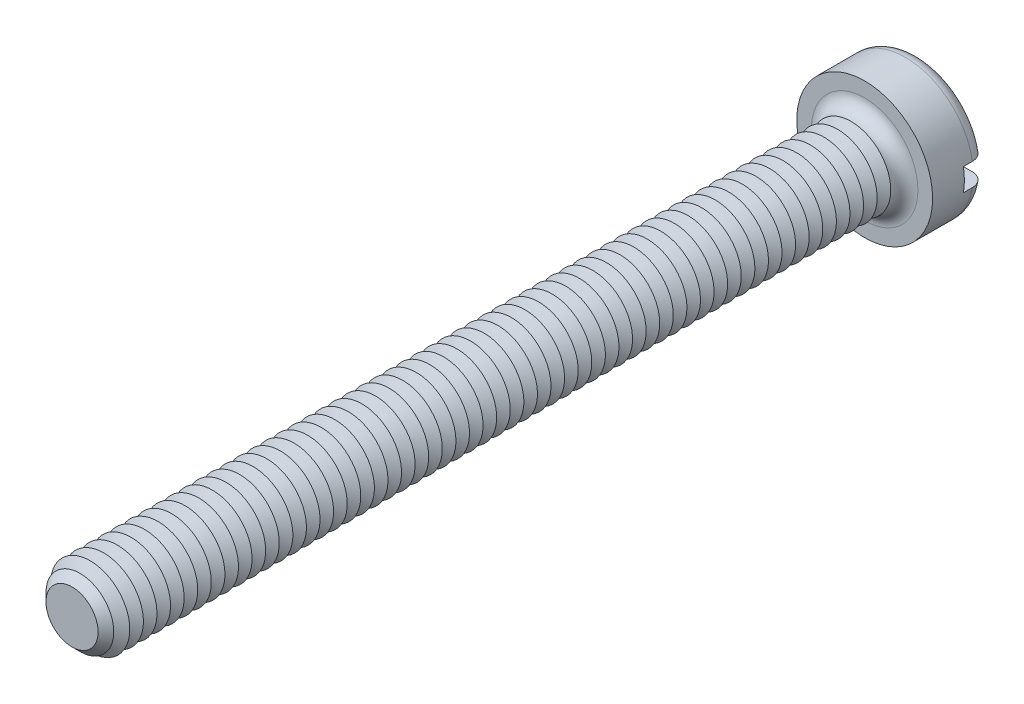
from build123d import *

# Parameters (mm, degrees)
SKETCH3_R           = 3
BOSS_EXTRUDE2_DEPTH = 2.4
SKETCH4_R           = 1.75
BOSS_EXTRUDE3_DEPTH = 35
FILLET1_R           = 0.6
CHAMFER1_SIZE       = 0.6
LPATTERN1_COUNT     = 57
LPATTERN1_PITCH     = 0.6
SKETCH8_W           = 6
SKETCH8_H           = 1
CUT_EXTRUDE1_DEPTH  = 1


with BuildPart() as part:
    # Sketch3 → Boss-Extrude2 (new body)
    with BuildSketch(Plane.XY):
        Circle(SKETCH3_R)
    extrude(amount=-BOSS_EXTRUDE2_DEPTH)

    # Sketch4 → Boss-Extrude3 (add)
    with BuildSketch(Plane.XY):
        Circle(SKETCH4_R)
    extrude(amount=BOSS_EXTRUDE3_DEPTH)

    # Fillet1
    fillet1_edges = [part.edges().sort_by_distance(p)[0] for p in [
        (-3, 0, -2.4),
        (-1.75, 0, 0),
    ]]
    fillet(fillet1_edges, radius=FILLET1_R)

    # Chamfer1
    chamfer1_edges = [part.edges().sort_by_distance(p)[0] for p in [
        (-1.75, 0, 35),
    ]]
    chamfer(chamfer1_edges, length=CHAMFER1_SIZE)

    # Sketch6 → Cut-Revolve1 (revolve, cut)
    with BuildSketch(Plane(origin=(0, 0, 0), x_dir=(0, 0, -1), z_dir=(1, 0, 0)), mode=Mode.PRIVATE) as cut_revolve1_sk:
        Polygon((-0.6, 1.75), (-0.9, 1.230384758), (-1.2, 1.75), align=None)
    cut_revolve1 = revolve(cut_revolve1_sk.sketch.rotate(Axis((0, 0, -1.694361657), (0, 0, 1)), 90), axis=Axis((0, 0, -1.694361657), (0, 0, 1)), mode=Mode.SUBTRACT)

    # LPattern1: Cut-Revolve1 ×57
    with Locations(*[(0, 0, i * LPATTERN1_PITCH) for i in range(1, LPATTERN1_COUNT)]):
        add(cut_revolve1, mode=Mode.SUBTRACT)

    # Sketch8 → Cut-Extrude1 (cut)
    with BuildSketch(Plane(origin=(0, 0, -2.4), x_dir=(-1, 0, 0), z_dir=(0, 0, -1))):
        Rectangle(SKETCH8_W, SKETCH8_H)
    extrude(amount=-CUT_EXTRUDE1_DEPTH, mode=Mode.SUBTRACT)


solid = part.part
